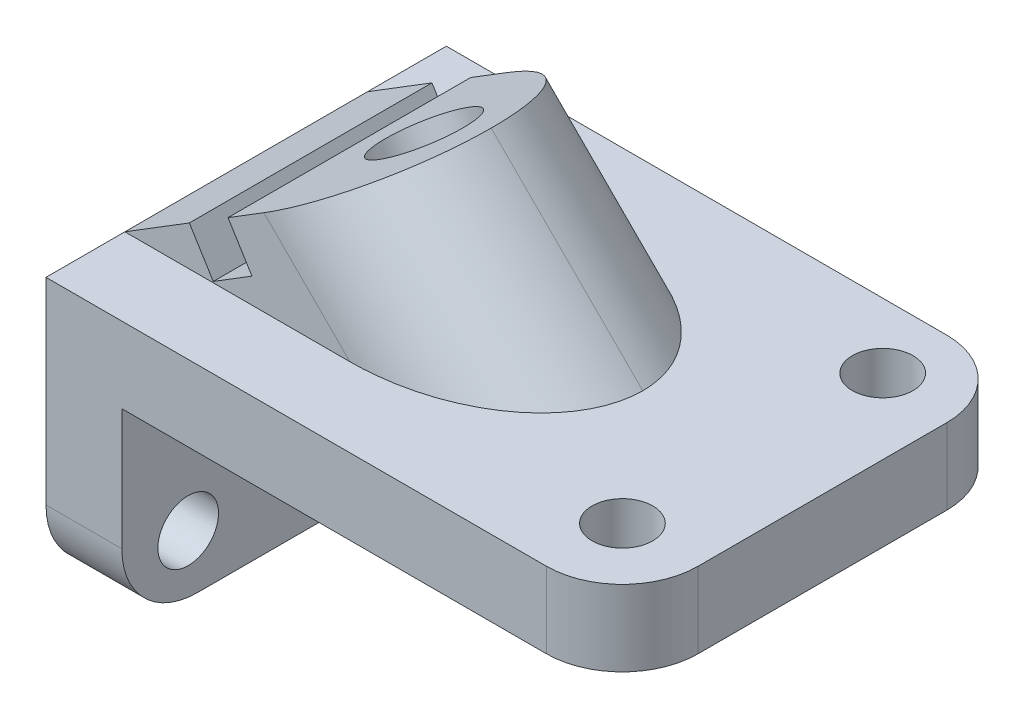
ISO-10303-21;
HEADER;
FILE_DESCRIPTION(('STEP AP214'),'2;1');
FILE_NAME('part.step','',(''),(''),'','','');
FILE_SCHEMA(('AUTOMOTIVE_DESIGN { 1 0 10303 214 1 1 1 1 }'));
ENDSEC;
DATA;
#1=APPLICATION_CONTEXT('core data for automotive mechanical design processes');
#2=APPLICATION_PROTOCOL_DEFINITION('international standard','automotive_design',2000,#1);
#3=PRODUCT_CONTEXT('',#1,'mechanical');
#4=PRODUCT('Part','Part','',(#3));
#5=PRODUCT_RELATED_PRODUCT_CATEGORY('part','',(#4));
#6=PRODUCT_DEFINITION_FORMATION('','',#4);
#7=PRODUCT_DEFINITION_CONTEXT('part definition',#1,'design');
#8=PRODUCT_DEFINITION('design','',#6,#7);
#9=PRODUCT_DEFINITION_SHAPE('','',#8);
#10=(LENGTH_UNIT() NAMED_UNIT(*) SI_UNIT(.MILLI.,.METRE.));
#11=(NAMED_UNIT(*) PLANE_ANGLE_UNIT() SI_UNIT($,.RADIAN.));
#12=(NAMED_UNIT(*) SI_UNIT($,.STERADIAN.) SOLID_ANGLE_UNIT());
#13=UNCERTAINTY_MEASURE_WITH_UNIT(LENGTH_MEASURE(1.E-05),#10,'distance_accuracy_value','');
#14=(GEOMETRIC_REPRESENTATION_CONTEXT(3) GLOBAL_UNCERTAINTY_ASSIGNED_CONTEXT((#13)) GLOBAL_UNIT_ASSIGNED_CONTEXT((#10,
#11,#12)) REPRESENTATION_CONTEXT('',''));
#15=CARTESIAN_POINT('',(0.,0.,0.));
#16=DIRECTION('',(0.,0.,1.));
#17=DIRECTION('',(1.,0.,0.));
#18=AXIS2_PLACEMENT_3D('',#15,#16,#17);
#19=CARTESIAN_POINT('',(-25.,25.,40.));
#20=DIRECTION('',(0.526315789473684,-0.850289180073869,0.));
#21=DIRECTION('',(0.850289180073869,0.526315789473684,0.));
#22=AXIS2_PLACEMENT_3D('',#19,#20,#21);
#23=PLANE('',#22);
#24=CARTESIAN_POINT('',(30.6674510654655,59.457287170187,-2.98131090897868));
#25=DIRECTION('',(-0.526315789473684,0.850289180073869,0.));
#26=DIRECTION('',(-0.850289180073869,-0.526315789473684,0.));
#27=AXIS2_PLACEMENT_3D('',#24,#25,#26);
#28=CIRCLE('',#27,15.);
#29=CARTESIAN_POINT('',(17.9131133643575,51.5625503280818,-2.98131090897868));
#30=VERTEX_POINT('',#29);
#31=EDGE_CURVE('E233',#30,#30,#28,.T.);
#32=ORIENTED_EDGE('',*,*,#31,.F.);
#33=EDGE_LOOP('',(#32));
#34=FACE_BOUND('',#33,.T.);
#35=CARTESIAN_POINT('',(20.8367151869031,53.3722144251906,0.));
#36=DIRECTION('',(0.526315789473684,-0.850289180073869,0.));
#37=DIRECTION('',(0.850289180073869,0.526315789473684,0.));
#38=AXIS2_PLACEMENT_3D('',#35,#36,#37);
#39=ELLIPSE('',#38,41.0927925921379,40.);
#40=CARTESIAN_POINT('',(20.8367151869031,53.3722144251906,40.));
#41=VERTEX_POINT('',#40);
#42=CARTESIAN_POINT('',(55.7774721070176,75.,0.));
#43=VERTEX_POINT('',#42);
#44=EDGE_CURVE('E202',#41,#43,#39,.F.);
#45=ORIENTED_EDGE('',*,*,#44,.T.);
#46=CARTESIAN_POINT('',(20.8367151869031,53.3722144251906,0.));
#47=DIRECTION('',(0.526315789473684,-0.850289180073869,0.));
#48=DIRECTION('',(-0.850289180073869,-0.526315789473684,0.));
#49=AXIS2_PLACEMENT_3D('',#46,#47,#48);
#50=ELLIPSE('',#49,41.0927925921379,40.);
#51=CARTESIAN_POINT('',(20.8367151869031,53.3722144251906,-40.));
#52=VERTEX_POINT('',#51);
#53=EDGE_CURVE('E212',#43,#52,#50,.F.);
#54=ORIENTED_EDGE('',*,*,#53,.T.);
#55=DIRECTION('',(-0.850289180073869,-0.526315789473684,0.));
#56=VECTOR('',#55,1.);
#57=CARTESIAN_POINT('',(-25.,25.,-40.));
#58=LINE('',#57,#56);
#59=CARTESIAN_POINT('',(9.01156720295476,46.0526315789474,-40.));
#60=VERTEX_POINT('',#59);
#61=EDGE_CURVE('E262',#52,#60,#58,.T.);
#62=ORIENTED_EDGE('',*,*,#61,.T.);
#63=DIRECTION('',(0.,0.,-1.));
#64=VECTOR('',#63,1.);
#65=CARTESIAN_POINT('',(9.01156720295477,46.0526315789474,40.));
#66=LINE('',#65,#64);
#67=CARTESIAN_POINT('',(9.01156720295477,46.0526315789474,40.));
#68=VERTEX_POINT('',#67);
#69=EDGE_CURVE('E253',#68,#60,#66,.T.);
#70=ORIENTED_EDGE('',*,*,#69,.F.);
#71=DIRECTION('',(-0.850289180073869,-0.526315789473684,0.));
#72=VECTOR('',#71,1.);
#73=CARTESIAN_POINT('',(-25.,25.,40.));
#74=LINE('',#73,#72);
#75=EDGE_CURVE('E263',#41,#68,#74,.T.);
#76=ORIENTED_EDGE('',*,*,#75,.F.);
#77=EDGE_LOOP('',(#45,#54,#62,#70,#76));
#78=FACE_BOUND('',#77,.T.);
#79=ADVANCED_FACE('F45',(#34,#78),#23,.F.);
#80=DIRECTION('',(0.,0.,1.));
#81=VECTOR('',#80,1.);
#82=CARTESIAN_POINT('',(-3.74277049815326,38.1578947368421,40.));
#83=LINE('',#82,#81);
#84=CARTESIAN_POINT('',(-3.74277049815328,38.1578947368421,-40.));
#85=VERTEX_POINT('',#84);
#86=CARTESIAN_POINT('',(-3.74277049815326,38.1578947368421,40.));
#87=VERTEX_POINT('',#86);
#88=EDGE_CURVE('E250',#85,#87,#83,.T.);
#89=ORIENTED_EDGE('',*,*,#88,.F.);
#90=CARTESIAN_POINT('',(-25.,25.,-40.));
#91=VERTEX_POINT('',#90);
#92=EDGE_CURVE('E195',#85,#91,#58,.T.);
#93=ORIENTED_EDGE('',*,*,#92,.T.);
#94=DIRECTION('',(0.,0.,-1.));
#95=VECTOR('',#94,1.);
#96=CARTESIAN_POINT('',(-25.,25.,40.));
#97=LINE('',#96,#95);
#98=CARTESIAN_POINT('',(-25.,25.,40.));
#99=VERTEX_POINT('',#98);
#100=EDGE_CURVE('E266',#99,#91,#97,.T.);
#101=ORIENTED_EDGE('',*,*,#100,.F.);
#102=EDGE_CURVE('E261',#87,#99,#74,.T.);
#103=ORIENTED_EDGE('',*,*,#102,.F.);
#104=EDGE_LOOP('',(#89,#93,#101,#103));
#105=FACE_BOUND('',#104,.T.);
#106=ADVANCED_FACE('F468',(#105),#23,.F.);
#107=CARTESIAN_POINT('',(0.,0.,40.));
#108=DIRECTION('',(0.,0.,1.));
#109=DIRECTION('',(1.,0.,0.));
#110=AXIS2_PLACEMENT_3D('',#107,#108,#109);
#111=PLANE('',#110);
#112=DIRECTION('',(1.,0.,0.));
#113=VECTOR('',#112,1.);
#114=CARTESIAN_POINT('',(105.777472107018,25.,40.));
#115=LINE('',#114,#113);
#116=CARTESIAN_POINT('',(49.208929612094,25.,40.));
#117=VERTEX_POINT('',#116);
#118=EDGE_CURVE('E258',#99,#117,#115,.T.);
#119=ORIENTED_EDGE('',*,*,#118,.T.);
#120=DIRECTION('',(-0.707106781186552,0.707106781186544,0.));
#121=VECTOR('',#120,1.);
#122=CARTESIAN_POINT('',(27.4932008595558,46.7157287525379,40.));
#123=LINE('',#122,#121);
#124=EDGE_CURVE('E219',#117,#41,#123,.T.);
#125=ORIENTED_EDGE('',*,*,#124,.T.);
#126=ORIENTED_EDGE('',*,*,#75,.T.);
#127=DIRECTION('',(0.526315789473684,-0.850289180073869,0.));
#128=VECTOR('',#127,1.);
#129=CARTESIAN_POINT('',(1.1168303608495,58.8069692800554,40.));
#130=LINE('',#129,#128);
#131=CARTESIAN_POINT('',(16.90630404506,33.2982938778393,40.));
#132=VERTEX_POINT('',#131);
#133=EDGE_CURVE('E244',#68,#132,#130,.T.);
#134=ORIENTED_EDGE('',*,*,#133,.T.);
#135=DIRECTION('',(0.850289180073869,0.526315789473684,0.));
#136=VECTOR('',#135,1.);
#137=CARTESIAN_POINT('',(16.90630404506,33.2982938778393,40.));
#138=LINE('',#137,#136);
#139=CARTESIAN_POINT('',(4.15196634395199,25.4035570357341,40.));
#140=VERTEX_POINT('',#139);
#141=EDGE_CURVE('E180',#140,#132,#138,.T.);
#142=ORIENTED_EDGE('',*,*,#141,.F.);
#143=DIRECTION('',(0.526315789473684,-0.850289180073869,0.));
#144=VECTOR('',#143,1.);
#145=CARTESIAN_POINT('',(-11.6375073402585,50.9122324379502,40.));
#146=LINE('',#145,#144);
#147=EDGE_CURVE('E175',#87,#140,#146,.T.);
#148=ORIENTED_EDGE('',*,*,#147,.F.);
#149=ORIENTED_EDGE('',*,*,#102,.T.);
#150=EDGE_LOOP('',(#119,#125,#126,#134,#142,#148,#149));
#151=FACE_BOUND('',#150,.T.);
#152=ADVANCED_FACE('F495',(#151),#111,.T.);
#153=CARTESIAN_POINT('',(0.,0.,-40.));
#154=DIRECTION('',(0.,0.,1.));
#155=DIRECTION('',(1.,0.,0.));
#156=AXIS2_PLACEMENT_3D('',#153,#154,#155);
#157=PLANE('',#156);
#158=ORIENTED_EDGE('',*,*,#61,.F.);
#159=DIRECTION('',(-0.707106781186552,0.707106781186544,0.));
#160=VECTOR('',#159,1.);
#161=CARTESIAN_POINT('',(37.1044648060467,37.1044648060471,-40.));
#162=LINE('',#161,#160);
#163=CARTESIAN_POINT('',(49.208929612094,25.,-40.));
#164=VERTEX_POINT('',#163);
#165=EDGE_CURVE('E215',#52,#164,#162,.F.);
#166=ORIENTED_EDGE('',*,*,#165,.T.);
#167=DIRECTION('',(1.,0.,0.));
#168=VECTOR('',#167,1.);
#169=CARTESIAN_POINT('',(105.777472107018,25.,-40.));
#170=LINE('',#169,#168);
#171=EDGE_CURVE('E257',#91,#164,#170,.T.);
#172=ORIENTED_EDGE('',*,*,#171,.F.);
#173=ORIENTED_EDGE('',*,*,#92,.F.);
#174=DIRECTION('',(-0.526315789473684,0.850289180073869,0.));
#175=VECTOR('',#174,1.);
#176=CARTESIAN_POINT('',(14.3704527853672,8.89508696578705,-40.));
#177=LINE('',#176,#175);
#178=CARTESIAN_POINT('',(4.15196634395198,25.4035570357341,-40.));
#179=VERTEX_POINT('',#178);
#180=EDGE_CURVE('E172',#179,#85,#177,.T.);
#181=ORIENTED_EDGE('',*,*,#180,.F.);
#182=DIRECTION('',(-0.850289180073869,-0.526315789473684,0.));
#183=VECTOR('',#182,1.);
#184=CARTESIAN_POINT('',(16.90630404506,33.2982938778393,-40.));
#185=LINE('',#184,#183);
#186=CARTESIAN_POINT('',(16.90630404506,33.2982938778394,-40.));
#187=VERTEX_POINT('',#186);
#188=EDGE_CURVE('E181',#187,#179,#185,.T.);
#189=ORIENTED_EDGE('',*,*,#188,.F.);
#190=DIRECTION('',(0.526315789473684,-0.850289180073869,0.));
#191=VECTOR('',#190,1.);
#192=CARTESIAN_POINT('',(27.1247904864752,16.7898238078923,-40.));
#193=LINE('',#192,#191);
#194=EDGE_CURVE('E197',#60,#187,#193,.T.);
#195=ORIENTED_EDGE('',*,*,#194,.F.);
#196=EDGE_LOOP('',(#158,#166,#172,#173,#181,#189,#195));
#197=FACE_BOUND('',#196,.T.);
#198=ADVANCED_FACE('F193',(#197),#157,.F.);
#199=CARTESIAN_POINT('',(0.,0.,66.));
#200=DIRECTION('',(-1.,0.,0.));
#201=DIRECTION('',(0.,-1.,0.));
#202=AXIS2_PLACEMENT_3D('',#199,#200,#201);
#203=PLANE('',#202);
#204=CARTESIAN_POINT('',(0.,-45.768622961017,44.1163839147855));
#205=DIRECTION('',(-1.,0.,0.));
#206=DIRECTION('',(0.,-1.,0.));
#207=AXIS2_PLACEMENT_3D('',#204,#205,#206);
#208=CIRCLE('',#207,10.);
#209=CARTESIAN_POINT('',(0.,-55.768622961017,44.1163839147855));
#210=VERTEX_POINT('',#209);
#211=EDGE_CURVE('E289',#210,#210,#208,.T.);
#212=ORIENTED_EDGE('',*,*,#211,.T.);
#213=EDGE_LOOP('',(#212));
#214=FACE_BOUND('',#213,.T.);
#215=CARTESIAN_POINT('',(0.,-45.768622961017,-42.8836160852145));
#216=DIRECTION('',(-1.,0.,0.));
#217=DIRECTION('',(0.,-1.,0.));
#218=AXIS2_PLACEMENT_3D('',#215,#216,#217);
#219=CIRCLE('',#218,10.);
#220=CARTESIAN_POINT('',(0.,-55.768622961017,-42.8836160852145));
#221=VERTEX_POINT('',#220);
#222=EDGE_CURVE('E284',#221,#221,#219,.T.);
#223=ORIENTED_EDGE('',*,*,#222,.T.);
#224=EDGE_LOOP('',(#223));
#225=FACE_BOUND('',#224,.T.);
#226=DIRECTION('',(0.,1.,0.));
#227=VECTOR('',#226,1.);
#228=CARTESIAN_POINT('',(0.,0.,66.));
#229=LINE('',#228,#227);
#230=CARTESIAN_POINT('',(0.,-40.,66.));
#231=VERTEX_POINT('',#230);
#232=CARTESIAN_POINT('',(0.,0.,66.));
#233=VERTEX_POINT('',#232);
#234=EDGE_CURVE('E294',#231,#233,#229,.T.);
#235=ORIENTED_EDGE('',*,*,#234,.F.);
#236=CARTESIAN_POINT('',(0.,-40.,41.));
#237=DIRECTION('',(-1.,0.,0.));
#238=DIRECTION('',(0.,-1.,0.));
#239=AXIS2_PLACEMENT_3D('',#236,#237,#238);
#240=CIRCLE('',#239,25.);
#241=CARTESIAN_POINT('',(0.,-65.,41.));
#242=VERTEX_POINT('',#241);
#243=EDGE_CURVE('E358',#231,#242,#240,.F.);
#244=ORIENTED_EDGE('',*,*,#243,.T.);
#245=DIRECTION('',(0.,0.,-1.));
#246=VECTOR('',#245,1.);
#247=CARTESIAN_POINT('',(0.,-65.,66.));
#248=LINE('',#247,#246);
#249=CARTESIAN_POINT('',(0.,-65.,-41.));
#250=VERTEX_POINT('',#249);
#251=EDGE_CURVE('E309',#242,#250,#248,.T.);
#252=ORIENTED_EDGE('',*,*,#251,.T.);
#253=CARTESIAN_POINT('',(0.,-40.,-41.));
#254=DIRECTION('',(-1.,0.,0.));
#255=DIRECTION('',(0.,-1.,0.));
#256=AXIS2_PLACEMENT_3D('',#253,#254,#255);
#257=CIRCLE('',#256,25.);
#258=CARTESIAN_POINT('',(0.,-40.,-66.));
#259=VERTEX_POINT('',#258);
#260=EDGE_CURVE('E355',#250,#259,#257,.F.);
#261=ORIENTED_EDGE('',*,*,#260,.T.);
#262=DIRECTION('',(0.,1.,0.));
#263=VECTOR('',#262,1.);
#264=CARTESIAN_POINT('',(0.,0.,-66.));
#265=LINE('',#264,#263);
#266=CARTESIAN_POINT('',(0.,0.,-66.));
#267=VERTEX_POINT('',#266);
#268=EDGE_CURVE('E293',#259,#267,#265,.T.);
#269=ORIENTED_EDGE('',*,*,#268,.T.);
#270=DIRECTION('',(0.,0.,-1.));
#271=VECTOR('',#270,1.);
#272=CARTESIAN_POINT('',(0.,0.,66.));
#273=LINE('',#272,#271);
#274=EDGE_CURVE('E343',#233,#267,#273,.T.);
#275=ORIENTED_EDGE('',*,*,#274,.F.);
#276=EDGE_LOOP('',(#235,#244,#252,#261,#269,#275));
#277=FACE_BOUND('',#276,.T.);
#278=ADVANCED_FACE('F418',(#214,#225,#277),#203,.F.);
#279=CARTESIAN_POINT('',(0.,0.,66.));
#280=DIRECTION('',(0.,1.,0.));
#281=DIRECTION('',(0.,0.,1.));
#282=AXIS2_PLACEMENT_3D('',#279,#280,#281);
#283=PLANE('',#282);
#284=CARTESIAN_POINT('',(67.4705878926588,0.,-2.98131090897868));
#285=DIRECTION('',(0.,1.,0.));
#286=DIRECTION('',(-1.,0.,0.));
#287=AXIS2_PLACEMENT_3D('',#284,#285,#286);
#288=ELLIPSE('',#287,17.6410571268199,15.);
#289=CARTESIAN_POINT('',(49.8295307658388,0.,-2.98131090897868));
#290=VERTEX_POINT('',#289);
#291=EDGE_CURVE('E49',#290,#290,#288,.T.);
#292=ORIENTED_EDGE('',*,*,#291,.T.);
#293=EDGE_LOOP('',(#292));
#294=FACE_BOUND('',#293,.T.);
#295=CARTESIAN_POINT('',(140.285841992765,0.,-44.5766194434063));
#296=DIRECTION('',(0.,1.,0.));
#297=DIRECTION('',(0.,0.,1.));
#298=AXIS2_PLACEMENT_3D('',#295,#296,#297);
#299=CIRCLE('',#298,10.);
#300=CARTESIAN_POINT('',(140.285841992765,0.,-34.5766194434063));
#301=VERTEX_POINT('',#300);
#302=EDGE_CURVE('E279',#301,#301,#299,.T.);
#303=ORIENTED_EDGE('',*,*,#302,.T.);
#304=EDGE_LOOP('',(#303));
#305=FACE_BOUND('',#304,.T.);
#306=CARTESIAN_POINT('',(140.285841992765,0.,41.2331639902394));
#307=DIRECTION('',(0.,1.,0.));
#308=DIRECTION('',(0.,0.,1.));
#309=AXIS2_PLACEMENT_3D('',#306,#307,#308);
#310=CIRCLE('',#309,10.);
#311=CARTESIAN_POINT('',(140.285841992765,0.,51.2331639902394));
#312=VERTEX_POINT('',#311);
#313=EDGE_CURVE('E275',#312,#312,#310,.T.);
#314=ORIENTED_EDGE('',*,*,#313,.T.);
#315=EDGE_LOOP('',(#314));
#316=FACE_BOUND('',#315,.T.);
#317=DIRECTION('',(1.,0.,0.));
#318=VECTOR('',#317,1.);
#319=CARTESIAN_POINT('',(0.,0.,-66.));
#320=LINE('',#319,#318);
#321=CARTESIAN_POINT('',(140.,0.,-66.));
#322=VERTEX_POINT('',#321);
#323=EDGE_CURVE('E312',#267,#322,#320,.T.);
#324=ORIENTED_EDGE('',*,*,#323,.T.);
#325=CARTESIAN_POINT('',(140.,0.,-41.));
#326=DIRECTION('',(0.,1.,0.));
#327=DIRECTION('',(0.,0.,1.));
#328=AXIS2_PLACEMENT_3D('',#325,#326,#327);
#329=CIRCLE('',#328,25.);
#330=CARTESIAN_POINT('',(165.,0.,-41.));
#331=VERTEX_POINT('',#330);
#332=EDGE_CURVE('E198',#322,#331,#329,.F.);
#333=ORIENTED_EDGE('',*,*,#332,.T.);
#334=DIRECTION('',(0.,0.,-1.));
#335=VECTOR('',#334,1.);
#336=CARTESIAN_POINT('',(165.,0.,66.));
#337=LINE('',#336,#335);
#338=CARTESIAN_POINT('',(165.,0.,41.));
#339=VERTEX_POINT('',#338);
#340=EDGE_CURVE('E339',#339,#331,#337,.T.);
#341=ORIENTED_EDGE('',*,*,#340,.F.);
#342=CARTESIAN_POINT('',(140.,0.,41.));
#343=DIRECTION('',(0.,1.,0.));
#344=DIRECTION('',(0.,0.,1.));
#345=AXIS2_PLACEMENT_3D('',#342,#343,#344);
#346=CIRCLE('',#345,25.);
#347=CARTESIAN_POINT('',(140.,0.,66.));
#348=VERTEX_POINT('',#347);
#349=EDGE_CURVE('E204',#339,#348,#346,.F.);
#350=ORIENTED_EDGE('',*,*,#349,.T.);
#351=DIRECTION('',(1.,0.,0.));
#352=VECTOR('',#351,1.);
#353=CARTESIAN_POINT('',(0.,0.,66.));
#354=LINE('',#353,#352);
#355=EDGE_CURVE('E297',#233,#348,#354,.T.);
#356=ORIENTED_EDGE('',*,*,#355,.F.);
#357=ORIENTED_EDGE('',*,*,#274,.T.);
#358=EDGE_LOOP('',(#324,#333,#341,#350,#356,#357));
#359=FACE_BOUND('',#358,.T.);
#360=ADVANCED_FACE('F414',(#294,#305,#316,#359),#283,.F.);
#361=CARTESIAN_POINT('',(165.,25.,66.));
#362=DIRECTION('',(-1.,0.,0.));
#363=DIRECTION('',(0.,-1.,0.));
#364=AXIS2_PLACEMENT_3D('',#361,#362,#363);
#365=PLANE('',#364);
#366=ORIENTED_EDGE('',*,*,#340,.T.);
#367=DIRECTION('',(0.,1.,0.));
#368=VECTOR('',#367,1.);
#369=CARTESIAN_POINT('',(165.,25.,-41.));
#370=LINE('',#369,#368);
#371=CARTESIAN_POINT('',(165.,25.,-41.));
#372=VERTEX_POINT('',#371);
#373=EDGE_CURVE('E383',#331,#372,#370,.T.);
#374=ORIENTED_EDGE('',*,*,#373,.T.);
#375=DIRECTION('',(0.,0.,-1.));
#376=VECTOR('',#375,1.);
#377=CARTESIAN_POINT('',(165.,25.,66.));
#378=LINE('',#377,#376);
#379=CARTESIAN_POINT('',(165.,25.,41.));
#380=VERTEX_POINT('',#379);
#381=EDGE_CURVE('E335',#380,#372,#378,.T.);
#382=ORIENTED_EDGE('',*,*,#381,.F.);
#383=DIRECTION('',(0.,1.,0.));
#384=VECTOR('',#383,1.);
#385=CARTESIAN_POINT('',(165.,25.,41.));
#386=LINE('',#385,#384);
#387=EDGE_CURVE('E380',#380,#339,#386,.F.);
#388=ORIENTED_EDGE('',*,*,#387,.T.);
#389=EDGE_LOOP('',(#366,#374,#382,#388));
#390=FACE_BOUND('',#389,.T.);
#391=ADVANCED_FACE('F417',(#390),#365,.F.);
#392=CARTESIAN_POINT('',(-25.,25.,66.));
#393=DIRECTION('',(0.,-1.,0.));
#394=DIRECTION('',(0.,0.,-1.));
#395=AXIS2_PLACEMENT_3D('',#392,#393,#394);
#396=PLANE('',#395);
#397=CARTESIAN_POINT('',(140.285841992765,25.,-44.5766194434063));
#398=DIRECTION('',(0.,-1.,0.));
#399=DIRECTION('',(0.,0.,-1.));
#400=AXIS2_PLACEMENT_3D('',#397,#398,#399);
#401=CIRCLE('',#400,10.);
#402=CARTESIAN_POINT('',(140.285841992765,25.,-34.5766194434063));
#403=VERTEX_POINT('',#402);
#404=EDGE_CURVE('E207',#403,#403,#401,.T.);
#405=ORIENTED_EDGE('',*,*,#404,.T.);
#406=EDGE_LOOP('',(#405));
#407=FACE_BOUND('',#406,.T.);
#408=CARTESIAN_POINT('',(140.285841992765,25.,41.2331639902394));
#409=DIRECTION('',(0.,-1.,0.));
#410=DIRECTION('',(0.,0.,-1.));
#411=AXIS2_PLACEMENT_3D('',#408,#409,#410);
#412=CIRCLE('',#411,10.);
#413=CARTESIAN_POINT('',(140.285841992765,25.,51.2331639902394));
#414=VERTEX_POINT('',#413);
#415=EDGE_CURVE('E274',#414,#414,#412,.T.);
#416=ORIENTED_EDGE('',*,*,#415,.T.);
#417=EDGE_LOOP('',(#416));
#418=FACE_BOUND('',#417,.T.);
#419=DIRECTION('',(0.,0.,-1.));
#420=VECTOR('',#419,1.);
#421=CARTESIAN_POINT('',(-25.,25.,66.));
#422=LINE('',#421,#420);
#423=CARTESIAN_POINT('',(-25.,25.,-66.));
#424=VERTEX_POINT('',#423);
#425=EDGE_CURVE('E330',#91,#424,#422,.T.);
#426=ORIENTED_EDGE('',*,*,#425,.F.);
#427=ORIENTED_EDGE('',*,*,#171,.T.);
#428=CARTESIAN_POINT('',(49.208929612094,25.,0.));
#429=DIRECTION('',(0.,-1.,0.));
#430=DIRECTION('',(-1.,0.,0.));
#431=AXIS2_PLACEMENT_3D('',#428,#429,#430);
#432=ELLIPSE('',#431,56.5685424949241,40.);
#433=CARTESIAN_POINT('',(105.777472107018,25.,0.));
#434=VERTEX_POINT('',#433);
#435=EDGE_CURVE('E55',#164,#434,#432,.T.);
#436=ORIENTED_EDGE('',*,*,#435,.T.);
#437=CARTESIAN_POINT('',(49.208929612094,25.,0.));
#438=DIRECTION('',(0.,-1.,0.));
#439=DIRECTION('',(1.,0.,0.));
#440=AXIS2_PLACEMENT_3D('',#437,#438,#439);
#441=ELLIPSE('',#440,56.5685424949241,40.);
#442=EDGE_CURVE('E11',#434,#117,#441,.T.);
#443=ORIENTED_EDGE('',*,*,#442,.T.);
#444=ORIENTED_EDGE('',*,*,#118,.F.);
#445=CARTESIAN_POINT('',(-25.,25.,66.));
#446=VERTEX_POINT('',#445);
#447=EDGE_CURVE('E331',#446,#99,#422,.T.);
#448=ORIENTED_EDGE('',*,*,#447,.F.);
#449=DIRECTION('',(-1.,0.,0.));
#450=VECTOR('',#449,1.);
#451=CARTESIAN_POINT('',(-25.,25.,66.));
#452=LINE('',#451,#450);
#453=CARTESIAN_POINT('',(140.,25.,66.));
#454=VERTEX_POINT('',#453);
#455=EDGE_CURVE('E302',#454,#446,#452,.T.);
#456=ORIENTED_EDGE('',*,*,#455,.F.);
#457=CARTESIAN_POINT('',(140.,25.,41.));
#458=DIRECTION('',(0.,-1.,0.));
#459=DIRECTION('',(0.,0.,-1.));
#460=AXIS2_PLACEMENT_3D('',#457,#458,#459);
#461=CIRCLE('',#460,25.);
#462=EDGE_CURVE('E387',#454,#380,#461,.F.);
#463=ORIENTED_EDGE('',*,*,#462,.T.);
#464=ORIENTED_EDGE('',*,*,#381,.T.);
#465=CARTESIAN_POINT('',(140.,25.,-41.));
#466=DIRECTION('',(0.,-1.,0.));
#467=DIRECTION('',(0.,0.,-1.));
#468=AXIS2_PLACEMENT_3D('',#465,#466,#467);
#469=CIRCLE('',#468,25.);
#470=CARTESIAN_POINT('',(140.,25.,-66.));
#471=VERTEX_POINT('',#470);
#472=EDGE_CURVE('E390',#372,#471,#469,.F.);
#473=ORIENTED_EDGE('',*,*,#472,.T.);
#474=DIRECTION('',(-1.,0.,0.));
#475=VECTOR('',#474,1.);
#476=CARTESIAN_POINT('',(-25.,25.,-66.));
#477=LINE('',#476,#475);
#478=EDGE_CURVE('E316',#471,#424,#477,.T.);
#479=ORIENTED_EDGE('',*,*,#478,.T.);
#480=EDGE_LOOP('',(#426,#427,#436,#443,#444,#448,#456,#463,#464,#473,#479));
#481=FACE_BOUND('',#480,.T.);
#482=ADVANCED_FACE('F404',(#407,#418,#481),#396,.F.);
#483=CARTESIAN_POINT('',(-25.,-65.,66.));
#484=DIRECTION('',(1.,0.,0.));
#485=DIRECTION('',(0.,1.,0.));
#486=AXIS2_PLACEMENT_3D('',#483,#484,#485);
#487=PLANE('',#486);
#488=CARTESIAN_POINT('',(-25.,-45.768622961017,44.1163839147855));
#489=DIRECTION('',(1.,0.,0.));
#490=DIRECTION('',(0.,1.,0.));
#491=AXIS2_PLACEMENT_3D('',#488,#489,#490);
#492=CIRCLE('',#491,10.);
#493=CARTESIAN_POINT('',(-25.,-35.768622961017,44.1163839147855));
#494=VERTEX_POINT('',#493);
#495=EDGE_CURVE('E288',#494,#494,#492,.T.);
#496=ORIENTED_EDGE('',*,*,#495,.T.);
#497=EDGE_LOOP('',(#496));
#498=FACE_BOUND('',#497,.T.);
#499=CARTESIAN_POINT('',(-25.,-45.768622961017,-42.8836160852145));
#500=DIRECTION('',(1.,0.,0.));
#501=DIRECTION('',(0.,1.,0.));
#502=AXIS2_PLACEMENT_3D('',#499,#500,#501);
#503=CIRCLE('',#502,10.);
#504=CARTESIAN_POINT('',(-25.,-35.768622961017,-42.8836160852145));
#505=VERTEX_POINT('',#504);
#506=EDGE_CURVE('E283',#505,#505,#503,.T.);
#507=ORIENTED_EDGE('',*,*,#506,.T.);
#508=EDGE_LOOP('',(#507));
#509=FACE_BOUND('',#508,.T.);
#510=DIRECTION('',(0.,0.,-1.));
#511=VECTOR('',#510,1.);
#512=CARTESIAN_POINT('',(-25.,-65.,66.));
#513=LINE('',#512,#511);
#514=CARTESIAN_POINT('',(-25.,-65.,41.));
#515=VERTEX_POINT('',#514);
#516=CARTESIAN_POINT('',(-25.,-65.,-41.));
#517=VERTEX_POINT('',#516);
#518=EDGE_CURVE('E326',#515,#517,#513,.T.);
#519=ORIENTED_EDGE('',*,*,#518,.F.);
#520=CARTESIAN_POINT('',(-25.,-40.,41.));
#521=DIRECTION('',(1.,0.,0.));
#522=DIRECTION('',(0.,1.,0.));
#523=AXIS2_PLACEMENT_3D('',#520,#521,#522);
#524=CIRCLE('',#523,25.);
#525=CARTESIAN_POINT('',(-25.,-40.,66.));
#526=VERTEX_POINT('',#525);
#527=EDGE_CURVE('E371',#515,#526,#524,.F.);
#528=ORIENTED_EDGE('',*,*,#527,.T.);
#529=DIRECTION('',(0.,-1.,0.));
#530=VECTOR('',#529,1.);
#531=CARTESIAN_POINT('',(-25.,-65.,66.));
#532=LINE('',#531,#530);
#533=EDGE_CURVE('E305',#446,#526,#532,.T.);
#534=ORIENTED_EDGE('',*,*,#533,.F.);
#535=ORIENTED_EDGE('',*,*,#447,.T.);
#536=ORIENTED_EDGE('',*,*,#100,.T.);
#537=ORIENTED_EDGE('',*,*,#425,.T.);
#538=DIRECTION('',(0.,-1.,0.));
#539=VECTOR('',#538,1.);
#540=CARTESIAN_POINT('',(-25.,-65.,-66.));
#541=LINE('',#540,#539);
#542=CARTESIAN_POINT('',(-25.,-40.,-66.));
#543=VERTEX_POINT('',#542);
#544=EDGE_CURVE('E298',#424,#543,#541,.T.);
#545=ORIENTED_EDGE('',*,*,#544,.T.);
#546=CARTESIAN_POINT('',(-25.,-40.,-41.));
#547=DIRECTION('',(1.,0.,0.));
#548=DIRECTION('',(0.,1.,0.));
#549=AXIS2_PLACEMENT_3D('',#546,#547,#548);
#550=CIRCLE('',#549,25.);
#551=EDGE_CURVE('E368',#543,#517,#550,.F.);
#552=ORIENTED_EDGE('',*,*,#551,.T.);
#553=EDGE_LOOP('',(#519,#528,#534,#535,#536,#537,#545,#552));
#554=FACE_BOUND('',#553,.T.);
#555=ADVANCED_FACE('F455',(#498,#509,#554),#487,.F.);
#556=CARTESIAN_POINT('',(0.,-65.,66.));
#557=DIRECTION('',(0.,1.,0.));
#558=DIRECTION('',(0.,0.,1.));
#559=AXIS2_PLACEMENT_3D('',#556,#557,#558);
#560=PLANE('',#559);
#561=ORIENTED_EDGE('',*,*,#251,.F.);
#562=DIRECTION('',(1.,0.,0.));
#563=VECTOR('',#562,1.);
#564=CARTESIAN_POINT('',(0.,-65.,41.));
#565=LINE('',#564,#563);
#566=EDGE_CURVE('E365',#242,#515,#565,.F.);
#567=ORIENTED_EDGE('',*,*,#566,.T.);
#568=ORIENTED_EDGE('',*,*,#518,.T.);
#569=DIRECTION('',(1.,0.,0.));
#570=VECTOR('',#569,1.);
#571=CARTESIAN_POINT('',(0.,-65.,-41.));
#572=LINE('',#571,#570);
#573=EDGE_CURVE('E361',#517,#250,#572,.T.);
#574=ORIENTED_EDGE('',*,*,#573,.T.);
#575=EDGE_LOOP('',(#561,#567,#568,#574));
#576=FACE_BOUND('',#575,.T.);
#577=ADVANCED_FACE('F459',(#576),#560,.F.);
#578=CARTESIAN_POINT('',(0.,0.,66.));
#579=DIRECTION('',(0.,0.,-1.));
#580=DIRECTION('',(-1.,0.,0.));
#581=AXIS2_PLACEMENT_3D('',#578,#579,#580);
#582=PLANE('',#581);
#583=ORIENTED_EDGE('',*,*,#533,.T.);
#584=DIRECTION('',(1.,0.,0.));
#585=VECTOR('',#584,1.);
#586=CARTESIAN_POINT('',(0.,-40.,66.));
#587=LINE('',#586,#585);
#588=EDGE_CURVE('E351',#526,#231,#587,.T.);
#589=ORIENTED_EDGE('',*,*,#588,.T.);
#590=ORIENTED_EDGE('',*,*,#234,.T.);
#591=ORIENTED_EDGE('',*,*,#355,.T.);
#592=DIRECTION('',(0.,1.,0.));
#593=VECTOR('',#592,1.);
#594=CARTESIAN_POINT('',(140.,1.55431223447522E-13,66.));
#595=LINE('',#594,#593);
#596=EDGE_CURVE('E347',#348,#454,#595,.T.);
#597=ORIENTED_EDGE('',*,*,#596,.T.);
#598=ORIENTED_EDGE('',*,*,#455,.T.);
#599=EDGE_LOOP('',(#583,#589,#590,#591,#597,#598));
#600=FACE_BOUND('',#599,.T.);
#601=ADVANCED_FACE('F443',(#600),#582,.F.);
#602=CARTESIAN_POINT('',(0.,0.,-66.));
#603=DIRECTION('',(0.,0.,-1.));
#604=DIRECTION('',(-1.,0.,0.));
#605=AXIS2_PLACEMENT_3D('',#602,#603,#604);
#606=PLANE('',#605);
#607=ORIENTED_EDGE('',*,*,#268,.F.);
#608=DIRECTION('',(1.,0.,0.));
#609=VECTOR('',#608,1.);
#610=CARTESIAN_POINT('',(-25.,-40.,-66.));
#611=LINE('',#610,#609);
#612=EDGE_CURVE('E377',#259,#543,#611,.F.);
#613=ORIENTED_EDGE('',*,*,#612,.T.);
#614=ORIENTED_EDGE('',*,*,#544,.F.);
#615=ORIENTED_EDGE('',*,*,#478,.F.);
#616=DIRECTION('',(0.,1.,0.));
#617=VECTOR('',#616,1.);
#618=CARTESIAN_POINT('',(140.,0.,-66.));
#619=LINE('',#618,#617);
#620=EDGE_CURVE('E374',#471,#322,#619,.F.);
#621=ORIENTED_EDGE('',*,*,#620,.T.);
#622=ORIENTED_EDGE('',*,*,#323,.F.);
#623=EDGE_LOOP('',(#607,#613,#614,#615,#621,#622));
#624=FACE_BOUND('',#623,.T.);
#625=ADVANCED_FACE('F447',(#624),#606,.T.);
#626=CARTESIAN_POINT('',(0.,-40.,41.));
#627=DIRECTION('',(1.,0.,0.));
#628=DIRECTION('',(0.,0.,-1.));
#629=AXIS2_PLACEMENT_3D('',#626,#627,#628);
#630=CYLINDRICAL_SURFACE('',#629,25.);
#631=ORIENTED_EDGE('',*,*,#527,.F.);
#632=ORIENTED_EDGE('',*,*,#566,.F.);
#633=ORIENTED_EDGE('',*,*,#243,.F.);
#634=ORIENTED_EDGE('',*,*,#588,.F.);
#635=EDGE_LOOP('',(#631,#632,#633,#634));
#636=FACE_BOUND('',#635,.T.);
#637=ADVANCED_FACE('F462',(#636),#630,.T.);
#638=CARTESIAN_POINT('',(0.,-40.,-41.));
#639=DIRECTION('',(-1.,0.,0.));
#640=DIRECTION('',(0.,0.,1.));
#641=AXIS2_PLACEMENT_3D('',#638,#639,#640);
#642=CYLINDRICAL_SURFACE('',#641,25.);
#643=ORIENTED_EDGE('',*,*,#551,.F.);
#644=ORIENTED_EDGE('',*,*,#612,.F.);
#645=ORIENTED_EDGE('',*,*,#260,.F.);
#646=ORIENTED_EDGE('',*,*,#573,.F.);
#647=EDGE_LOOP('',(#643,#644,#645,#646));
#648=FACE_BOUND('',#647,.T.);
#649=ADVANCED_FACE('F451',(#648),#642,.T.);
#650=CARTESIAN_POINT('',(140.,25.,-41.));
#651=DIRECTION('',(0.,-1.,0.));
#652=DIRECTION('',(1.,0.,0.));
#653=AXIS2_PLACEMENT_3D('',#650,#651,#652);
#654=CYLINDRICAL_SURFACE('',#653,25.);
#655=ORIENTED_EDGE('',*,*,#332,.F.);
#656=ORIENTED_EDGE('',*,*,#620,.F.);
#657=ORIENTED_EDGE('',*,*,#472,.F.);
#658=ORIENTED_EDGE('',*,*,#373,.F.);
#659=EDGE_LOOP('',(#655,#656,#657,#658));
#660=FACE_BOUND('',#659,.T.);
#661=ADVANCED_FACE('F430',(#660),#654,.T.);
#662=CARTESIAN_POINT('',(140.,1.55431223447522E-13,41.));
#663=DIRECTION('',(0.,1.,0.));
#664=DIRECTION('',(-1.,0.,0.));
#665=AXIS2_PLACEMENT_3D('',#662,#663,#664);
#666=CYLINDRICAL_SURFACE('',#665,25.);
#667=ORIENTED_EDGE('',*,*,#349,.F.);
#668=ORIENTED_EDGE('',*,*,#387,.F.);
#669=ORIENTED_EDGE('',*,*,#462,.F.);
#670=ORIENTED_EDGE('',*,*,#596,.F.);
#671=EDGE_LOOP('',(#667,#668,#669,#670));
#672=FACE_BOUND('',#671,.T.);
#673=ADVANCED_FACE('F441',(#672),#666,.T.);
#674=CARTESIAN_POINT('',(165.,-45.768622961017,-42.8836160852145));
#675=DIRECTION('',(-1.,0.,0.));
#676=DIRECTION('',(0.,-1.,0.));
#677=AXIS2_PLACEMENT_3D('',#674,#675,#676);
#678=CYLINDRICAL_SURFACE('',#677,10.);
#679=ORIENTED_EDGE('',*,*,#506,.F.);
#680=EDGE_LOOP('',(#679));
#681=FACE_BOUND('',#680,.T.);
#682=ORIENTED_EDGE('',*,*,#222,.F.);
#683=EDGE_LOOP('',(#682));
#684=FACE_BOUND('',#683,.T.);
#685=ADVANCED_FACE('F520',(#681,#684),#678,.F.);
#686=CARTESIAN_POINT('',(165.,-45.768622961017,44.1163839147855));
#687=DIRECTION('',(-1.,0.,0.));
#688=DIRECTION('',(0.,-1.,0.));
#689=AXIS2_PLACEMENT_3D('',#686,#687,#688);
#690=CYLINDRICAL_SURFACE('',#689,10.);
#691=ORIENTED_EDGE('',*,*,#495,.F.);
#692=EDGE_LOOP('',(#691));
#693=FACE_BOUND('',#692,.T.);
#694=ORIENTED_EDGE('',*,*,#211,.F.);
#695=EDGE_LOOP('',(#694));
#696=FACE_BOUND('',#695,.T.);
#697=ADVANCED_FACE('F410',(#693,#696),#690,.F.);
#698=CARTESIAN_POINT('',(140.285841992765,-65.,41.2331639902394));
#699=DIRECTION('',(0.,1.,0.));
#700=DIRECTION('',(0.,0.,1.));
#701=AXIS2_PLACEMENT_3D('',#698,#699,#700);
#702=CYLINDRICAL_SURFACE('',#701,10.);
#703=CARTESIAN_POINT('',(140.285841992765,25.,51.2331639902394));
#704=CARTESIAN_POINT('',(140.285841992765,24.7395833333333,51.2331639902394));
#705=CARTESIAN_POINT('',(140.285841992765,24.4791666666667,51.2331639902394));
#706=CARTESIAN_POINT('',(140.285841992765,23.9583333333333,51.2331639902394));
#707=CARTESIAN_POINT('',(140.285841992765,23.6979166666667,51.2331639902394));
#708=CARTESIAN_POINT('',(140.285841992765,23.1770833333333,51.2331639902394));
#709=CARTESIAN_POINT('',(140.285841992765,22.9166666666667,51.2331639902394));
#710=CARTESIAN_POINT('',(140.285841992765,22.3958333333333,51.2331639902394));
#711=CARTESIAN_POINT('',(140.285841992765,22.1354166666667,51.2331639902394));
#712=CARTESIAN_POINT('',(140.285841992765,21.6145833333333,51.2331639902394));
#713=CARTESIAN_POINT('',(140.285841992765,21.3541666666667,51.2331639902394));
#714=CARTESIAN_POINT('',(140.285841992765,20.8333333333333,51.2331639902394));
#715=CARTESIAN_POINT('',(140.285841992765,20.5729166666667,51.2331639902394));
#716=CARTESIAN_POINT('',(140.285841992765,20.0520833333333,51.2331639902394));
#717=CARTESIAN_POINT('',(140.285841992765,19.7916666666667,51.2331639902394));
#718=CARTESIAN_POINT('',(140.285841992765,19.2708333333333,51.2331639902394));
#719=CARTESIAN_POINT('',(140.285841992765,19.0104166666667,51.2331639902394));
#720=CARTESIAN_POINT('',(140.285841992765,18.4895833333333,51.2331639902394));
#721=CARTESIAN_POINT('',(140.285841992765,18.2291666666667,51.2331639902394));
#722=CARTESIAN_POINT('',(140.285841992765,17.7083333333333,51.2331639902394));
#723=CARTESIAN_POINT('',(140.285841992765,17.4479166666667,51.2331639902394));
#724=CARTESIAN_POINT('',(140.285841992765,16.9270833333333,51.2331639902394));
#725=CARTESIAN_POINT('',(140.285841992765,16.6666666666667,51.2331639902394));
#726=CARTESIAN_POINT('',(140.285841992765,16.1458333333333,51.2331639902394));
#727=CARTESIAN_POINT('',(140.285841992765,15.8854166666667,51.2331639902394));
#728=CARTESIAN_POINT('',(140.285841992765,15.3645833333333,51.2331639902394));
#729=CARTESIAN_POINT('',(140.285841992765,15.1041666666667,51.2331639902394));
#730=CARTESIAN_POINT('',(140.285841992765,14.5833333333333,51.2331639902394));
#731=CARTESIAN_POINT('',(140.285841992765,14.3229166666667,51.2331639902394));
#732=CARTESIAN_POINT('',(140.285841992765,13.8020833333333,51.2331639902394));
#733=CARTESIAN_POINT('',(140.285841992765,13.5416666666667,51.2331639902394));
#734=CARTESIAN_POINT('',(140.285841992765,13.0208333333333,51.2331639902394));
#735=CARTESIAN_POINT('',(140.285841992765,12.7604166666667,51.2331639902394));
#736=CARTESIAN_POINT('',(140.285841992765,12.2395833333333,51.2331639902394));
#737=CARTESIAN_POINT('',(140.285841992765,11.9791666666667,51.2331639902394));
#738=CARTESIAN_POINT('',(140.285841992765,11.4583333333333,51.2331639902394));
#739=CARTESIAN_POINT('',(140.285841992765,11.1979166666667,51.2331639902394));
#740=CARTESIAN_POINT('',(140.285841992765,10.6770833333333,51.2331639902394));
#741=CARTESIAN_POINT('',(140.285841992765,10.4166666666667,51.2331639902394));
#742=CARTESIAN_POINT('',(140.285841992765,9.89583333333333,51.2331639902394));
#743=CARTESIAN_POINT('',(140.285841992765,9.63541666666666,51.2331639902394));
#744=CARTESIAN_POINT('',(140.285841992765,9.11458333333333,51.2331639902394));
#745=CARTESIAN_POINT('',(140.285841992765,8.85416666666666,51.2331639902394));
#746=CARTESIAN_POINT('',(140.285841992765,8.33333333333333,51.2331639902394));
#747=CARTESIAN_POINT('',(140.285841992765,8.07291666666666,51.2331639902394));
#748=CARTESIAN_POINT('',(140.285841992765,7.55208333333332,51.2331639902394));
#749=CARTESIAN_POINT('',(140.285841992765,7.29166666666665,51.2331639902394));
#750=CARTESIAN_POINT('',(140.285841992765,6.77083333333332,51.2331639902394));
#751=CARTESIAN_POINT('',(140.285841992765,6.51041666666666,51.2331639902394));
#752=CARTESIAN_POINT('',(140.285841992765,5.98958333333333,51.2331639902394));
#753=CARTESIAN_POINT('',(140.285841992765,5.72916666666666,51.2331639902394));
#754=CARTESIAN_POINT('',(140.285841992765,5.20833333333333,51.2331639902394));
#755=CARTESIAN_POINT('',(140.285841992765,4.94791666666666,51.2331639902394));
#756=CARTESIAN_POINT('',(140.285841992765,4.42708333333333,51.2331639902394));
#757=CARTESIAN_POINT('',(140.285841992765,4.16666666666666,51.2331639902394));
#758=CARTESIAN_POINT('',(140.285841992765,3.64583333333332,51.2331639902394));
#759=CARTESIAN_POINT('',(140.285841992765,3.38541666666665,51.2331639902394));
#760=CARTESIAN_POINT('',(140.285841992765,2.86458333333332,51.2331639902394));
#761=CARTESIAN_POINT('',(140.285841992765,2.60416666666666,51.2331639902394));
#762=CARTESIAN_POINT('',(140.285841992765,2.08333333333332,51.2331639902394));
#763=CARTESIAN_POINT('',(140.285841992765,1.82291666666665,51.2331639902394));
#764=CARTESIAN_POINT('',(140.285841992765,1.30208333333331,51.2331639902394));
#765=CARTESIAN_POINT('',(140.285841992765,1.04166666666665,51.2331639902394));
#766=CARTESIAN_POINT('',(140.285841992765,0.520833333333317,51.2331639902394));
#767=CARTESIAN_POINT('',(140.285841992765,0.260416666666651,51.2331639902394));
#768=CARTESIAN_POINT('',(140.285841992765,0.,51.2331639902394));
#769=B_SPLINE_CURVE_WITH_KNOTS('',3,(#703,#704,#705,#706,#707,#708,#709,#710,#711,#712,#713,
#714,#715,#716,#717,#718,#719,#720,#721,#722,#723,#724,#725,#726,#727,#728,#729,#730,#731,#732,
#733,#734,#735,#736,#737,#738,#739,#740,#741,#742,#743,#744,#745,#746,#747,#748,#749,#750,#751,
#752,#753,#754,#755,#756,#757,#758,#759,#760,#761,#762,#763,#764,#765,#766,#767,#768),
.UNSPECIFIED.,.F.,.F.,(4,2,2,2,2,2,2,2,2,2,2,2,2,2,2,2,2,2,2,2,2,2,2,2,2,2,2,2,2,2,2,2,4),(0.,
0.781249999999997,1.56249999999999,2.34375000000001,3.125,3.90625,4.68750000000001,
5.46875000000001,6.25000000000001,7.03125,7.8125,8.59375000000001,9.37500000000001,10.15625,
10.9375,11.71875,12.5,13.28125,14.0625,14.84375,15.625,16.40625,17.1875,17.96875,18.75,19.53125,
20.3125,21.09375,21.875,22.65625,23.4375,24.21875,25.),.UNSPECIFIED.);
#770=EDGE_CURVE('BSEAM406',#414,#312,#769,.T.);
#771=ORIENTED_EDGE('',*,*,#415,.F.);
#772=ORIENTED_EDGE('',*,*,#313,.F.);
#773=ORIENTED_EDGE('',*,*,#770,.T.);
#774=ORIENTED_EDGE('',*,*,#770,.F.);
#775=EDGE_LOOP('',(#771,#773,#772,#774));
#776=FACE_BOUND('',#775,.T.);
#777=ADVANCED_FACE('F406',(#776),#702,.F.);
#778=CARTESIAN_POINT('',(140.285841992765,-65.,-44.5766194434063));
#779=DIRECTION('',(0.,1.,0.));
#780=DIRECTION('',(0.,0.,1.));
#781=AXIS2_PLACEMENT_3D('',#778,#779,#780);
#782=CYLINDRICAL_SURFACE('',#781,10.);
#783=CARTESIAN_POINT('',(140.285841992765,25.,-34.5766194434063));
#784=CARTESIAN_POINT('',(140.285841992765,24.7395833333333,-34.5766194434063));
#785=CARTESIAN_POINT('',(140.285841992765,24.4791666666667,-34.5766194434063));
#786=CARTESIAN_POINT('',(140.285841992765,23.9583333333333,-34.5766194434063));
#787=CARTESIAN_POINT('',(140.285841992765,23.6979166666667,-34.5766194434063));
#788=CARTESIAN_POINT('',(140.285841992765,23.1770833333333,-34.5766194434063));
#789=CARTESIAN_POINT('',(140.285841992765,22.9166666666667,-34.5766194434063));
#790=CARTESIAN_POINT('',(140.285841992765,22.3958333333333,-34.5766194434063));
#791=CARTESIAN_POINT('',(140.285841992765,22.1354166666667,-34.5766194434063));
#792=CARTESIAN_POINT('',(140.285841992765,21.6145833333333,-34.5766194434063));
#793=CARTESIAN_POINT('',(140.285841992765,21.3541666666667,-34.5766194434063));
#794=CARTESIAN_POINT('',(140.285841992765,20.8333333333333,-34.5766194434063));
#795=CARTESIAN_POINT('',(140.285841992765,20.5729166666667,-34.5766194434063));
#796=CARTESIAN_POINT('',(140.285841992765,20.0520833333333,-34.5766194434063));
#797=CARTESIAN_POINT('',(140.285841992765,19.7916666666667,-34.5766194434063));
#798=CARTESIAN_POINT('',(140.285841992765,19.2708333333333,-34.5766194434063));
#799=CARTESIAN_POINT('',(140.285841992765,19.0104166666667,-34.5766194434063));
#800=CARTESIAN_POINT('',(140.285841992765,18.4895833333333,-34.5766194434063));
#801=CARTESIAN_POINT('',(140.285841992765,18.2291666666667,-34.5766194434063));
#802=CARTESIAN_POINT('',(140.285841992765,17.7083333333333,-34.5766194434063));
#803=CARTESIAN_POINT('',(140.285841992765,17.4479166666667,-34.5766194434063));
#804=CARTESIAN_POINT('',(140.285841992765,16.9270833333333,-34.5766194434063));
#805=CARTESIAN_POINT('',(140.285841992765,16.6666666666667,-34.5766194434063));
#806=CARTESIAN_POINT('',(140.285841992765,16.1458333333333,-34.5766194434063));
#807=CARTESIAN_POINT('',(140.285841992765,15.8854166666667,-34.5766194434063));
#808=CARTESIAN_POINT('',(140.285841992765,15.3645833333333,-34.5766194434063));
#809=CARTESIAN_POINT('',(140.285841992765,15.1041666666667,-34.5766194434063));
#810=CARTESIAN_POINT('',(140.285841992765,14.5833333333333,-34.5766194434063));
#811=CARTESIAN_POINT('',(140.285841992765,14.3229166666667,-34.5766194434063));
#812=CARTESIAN_POINT('',(140.285841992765,13.8020833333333,-34.5766194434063));
#813=CARTESIAN_POINT('',(140.285841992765,13.5416666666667,-34.5766194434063));
#814=CARTESIAN_POINT('',(140.285841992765,13.0208333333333,-34.5766194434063));
#815=CARTESIAN_POINT('',(140.285841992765,12.7604166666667,-34.5766194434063));
#816=CARTESIAN_POINT('',(140.285841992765,12.2395833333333,-34.5766194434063));
#817=CARTESIAN_POINT('',(140.285841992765,11.9791666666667,-34.5766194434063));
#818=CARTESIAN_POINT('',(140.285841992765,11.4583333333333,-34.5766194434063));
#819=CARTESIAN_POINT('',(140.285841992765,11.1979166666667,-34.5766194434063));
#820=CARTESIAN_POINT('',(140.285841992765,10.6770833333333,-34.5766194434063));
#821=CARTESIAN_POINT('',(140.285841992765,10.4166666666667,-34.5766194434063));
#822=CARTESIAN_POINT('',(140.285841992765,9.89583333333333,-34.5766194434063));
#823=CARTESIAN_POINT('',(140.285841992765,9.63541666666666,-34.5766194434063));
#824=CARTESIAN_POINT('',(140.285841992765,9.11458333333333,-34.5766194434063));
#825=CARTESIAN_POINT('',(140.285841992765,8.85416666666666,-34.5766194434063));
#826=CARTESIAN_POINT('',(140.285841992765,8.33333333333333,-34.5766194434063));
#827=CARTESIAN_POINT('',(140.285841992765,8.07291666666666,-34.5766194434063));
#828=CARTESIAN_POINT('',(140.285841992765,7.55208333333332,-34.5766194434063));
#829=CARTESIAN_POINT('',(140.285841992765,7.29166666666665,-34.5766194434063));
#830=CARTESIAN_POINT('',(140.285841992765,6.77083333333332,-34.5766194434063));
#831=CARTESIAN_POINT('',(140.285841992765,6.51041666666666,-34.5766194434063));
#832=CARTESIAN_POINT('',(140.285841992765,5.98958333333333,-34.5766194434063));
#833=CARTESIAN_POINT('',(140.285841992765,5.72916666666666,-34.5766194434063));
#834=CARTESIAN_POINT('',(140.285841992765,5.20833333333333,-34.5766194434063));
#835=CARTESIAN_POINT('',(140.285841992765,4.94791666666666,-34.5766194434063));
#836=CARTESIAN_POINT('',(140.285841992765,4.42708333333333,-34.5766194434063));
#837=CARTESIAN_POINT('',(140.285841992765,4.16666666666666,-34.5766194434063));
#838=CARTESIAN_POINT('',(140.285841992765,3.64583333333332,-34.5766194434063));
#839=CARTESIAN_POINT('',(140.285841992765,3.38541666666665,-34.5766194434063));
#840=CARTESIAN_POINT('',(140.285841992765,2.86458333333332,-34.5766194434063));
#841=CARTESIAN_POINT('',(140.285841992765,2.60416666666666,-34.5766194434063));
#842=CARTESIAN_POINT('',(140.285841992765,2.08333333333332,-34.5766194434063));
#843=CARTESIAN_POINT('',(140.285841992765,1.82291666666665,-34.5766194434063));
#844=CARTESIAN_POINT('',(140.285841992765,1.30208333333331,-34.5766194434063));
#845=CARTESIAN_POINT('',(140.285841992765,1.04166666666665,-34.5766194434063));
#846=CARTESIAN_POINT('',(140.285841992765,0.520833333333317,-34.5766194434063));
#847=CARTESIAN_POINT('',(140.285841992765,0.260416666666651,-34.5766194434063));
#848=CARTESIAN_POINT('',(140.285841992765,0.,-34.5766194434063));
#849=B_SPLINE_CURVE_WITH_KNOTS('',3,(#783,#784,#785,#786,#787,#788,#789,#790,#791,#792,#793,
#794,#795,#796,#797,#798,#799,#800,#801,#802,#803,#804,#805,#806,#807,#808,#809,#810,#811,#812,
#813,#814,#815,#816,#817,#818,#819,#820,#821,#822,#823,#824,#825,#826,#827,#828,#829,#830,#831,
#832,#833,#834,#835,#836,#837,#838,#839,#840,#841,#842,#843,#844,#845,#846,#847,#848),
.UNSPECIFIED.,.F.,.F.,(4,2,2,2,2,2,2,2,2,2,2,2,2,2,2,2,2,2,2,2,2,2,2,2,2,2,2,2,2,2,2,2,4),(0.,
0.781249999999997,1.56249999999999,2.34375000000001,3.125,3.90625,4.68750000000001,
5.46875000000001,6.25000000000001,7.03125,7.8125,8.59375000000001,9.37500000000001,10.15625,
10.9375,11.71875,12.5,13.28125,14.0625,14.84375,15.625,16.40625,17.1875,17.96875,18.75,19.53125,
20.3125,21.09375,21.875,22.65625,23.4375,24.21875,25.),.UNSPECIFIED.);
#850=EDGE_CURVE('BSEAM409',#403,#301,#849,.T.);
#851=ORIENTED_EDGE('',*,*,#404,.F.);
#852=ORIENTED_EDGE('',*,*,#302,.F.);
#853=ORIENTED_EDGE('',*,*,#850,.T.);
#854=ORIENTED_EDGE('',*,*,#850,.F.);
#855=EDGE_LOOP('',(#851,#853,#852,#854));
#856=FACE_BOUND('',#855,.T.);
#857=ADVANCED_FACE('F409',(#856),#782,.F.);
#858=CARTESIAN_POINT('',(1.11683036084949,58.8069692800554,-40.));
#859=DIRECTION('',(-0.850289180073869,-0.526315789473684,0.));
#860=DIRECTION('',(0.526315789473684,-0.850289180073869,0.));
#861=AXIS2_PLACEMENT_3D('',#858,#859,#860);
#862=PLANE('',#861);
#863=ORIENTED_EDGE('',*,*,#69,.T.);
#864=ORIENTED_EDGE('',*,*,#194,.T.);
#865=DIRECTION('',(0.,0.,-1.));
#866=VECTOR('',#865,1.);
#867=CARTESIAN_POINT('',(16.90630404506,33.2982938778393,-40.));
#868=LINE('',#867,#866);
#869=EDGE_CURVE('E185',#132,#187,#868,.T.);
#870=ORIENTED_EDGE('',*,*,#869,.F.);
#871=ORIENTED_EDGE('',*,*,#133,.F.);
#872=EDGE_LOOP('',(#863,#864,#870,#871));
#873=FACE_BOUND('',#872,.T.);
#874=ADVANCED_FACE('F478',(#873),#862,.T.);
#875=CARTESIAN_POINT('',(-11.6375073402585,50.9122324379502,-40.));
#876=DIRECTION('',(0.850289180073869,0.526315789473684,0.));
#877=DIRECTION('',(-0.526315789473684,0.850289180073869,0.));
#878=AXIS2_PLACEMENT_3D('',#875,#876,#877);
#879=PLANE('',#878);
#880=ORIENTED_EDGE('',*,*,#88,.T.);
#881=ORIENTED_EDGE('',*,*,#147,.T.);
#882=DIRECTION('',(0.,0.,1.));
#883=VECTOR('',#882,1.);
#884=CARTESIAN_POINT('',(4.15196634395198,25.4035570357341,-40.));
#885=LINE('',#884,#883);
#886=EDGE_CURVE('E168',#179,#140,#885,.T.);
#887=ORIENTED_EDGE('',*,*,#886,.F.);
#888=ORIENTED_EDGE('',*,*,#180,.T.);
#889=EDGE_LOOP('',(#880,#881,#887,#888));
#890=FACE_BOUND('',#889,.T.);
#891=ADVANCED_FACE('F170',(#890),#879,.T.);
#892=CARTESIAN_POINT('',(-10.2184864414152,16.508470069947,0.));
#893=DIRECTION('',(0.526315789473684,-0.850289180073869,0.));
#894=DIRECTION('',(0.850289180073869,0.526315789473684,0.));
#895=AXIS2_PLACEMENT_3D('',#892,#893,#894);
#896=PLANE('',#895);
#897=ORIENTED_EDGE('',*,*,#869,.T.);
#898=ORIENTED_EDGE('',*,*,#188,.T.);
#899=ORIENTED_EDGE('',*,*,#886,.T.);
#900=ORIENTED_EDGE('',*,*,#141,.T.);
#901=EDGE_LOOP('',(#897,#898,#899,#900));
#902=FACE_BOUND('',#901,.T.);
#903=ADVANCED_FACE('F184',(#902),#896,.F.);
#904=CARTESIAN_POINT('',(37.1044648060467,37.1044648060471,0.));
#905=DIRECTION('',(0.707106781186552,-0.707106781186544,0.));
#906=DIRECTION('',(0.707106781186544,0.707106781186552,0.));
#907=AXIS2_PLACEMENT_3D('',#904,#905,#906);
#908=CYLINDRICAL_SURFACE('',#907,40.);
#909=ORIENTED_EDGE('',*,*,#124,.F.);
#910=ORIENTED_EDGE('',*,*,#442,.F.);
#911=DIRECTION('',(-0.707106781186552,0.707106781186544,0.));
#912=VECTOR('',#911,1.);
#913=CARTESIAN_POINT('',(105.777472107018,25.,0.));
#914=LINE('',#913,#912);
#915=EDGE_CURVE('E223',#43,#434,#914,.F.);
#916=ORIENTED_EDGE('',*,*,#915,.F.);
#917=ORIENTED_EDGE('',*,*,#44,.F.);
#918=EDGE_LOOP('',(#909,#910,#916,#917));
#919=FACE_BOUND('',#918,.T.);
#920=ADVANCED_FACE('F47',(#919),#908,.T.);
#921=CARTESIAN_POINT('',(27.4932008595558,46.7157287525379,0.));
#922=DIRECTION('',(-0.707106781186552,0.707106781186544,0.));
#923=DIRECTION('',(-0.707106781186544,-0.707106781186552,0.));
#924=AXIS2_PLACEMENT_3D('',#921,#922,#923);
#925=CYLINDRICAL_SURFACE('',#924,40.);
#926=ORIENTED_EDGE('',*,*,#435,.F.);
#927=ORIENTED_EDGE('',*,*,#165,.F.);
#928=ORIENTED_EDGE('',*,*,#53,.F.);
#929=ORIENTED_EDGE('',*,*,#915,.T.);
#930=EDGE_LOOP('',(#926,#927,#928,#929));
#931=FACE_BOUND('',#930,.T.);
#932=ADVANCED_FACE('F509',(#931),#925,.T.);
#933=CARTESIAN_POINT('',(123.57588591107,-90.6408829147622,-2.98131090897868));
#934=DIRECTION('',(-0.526315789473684,0.850289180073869,0.));
#935=DIRECTION('',(-0.850289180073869,-0.526315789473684,0.));
#936=AXIS2_PLACEMENT_3D('',#933,#934,#935);
#937=CYLINDRICAL_SURFACE('',#936,15.);
#938=ORIENTED_EDGE('',*,*,#31,.T.);
#939=EDGE_LOOP('',(#938));
#940=FACE_BOUND('',#939,.T.);
#941=ORIENTED_EDGE('',*,*,#291,.F.);
#942=EDGE_LOOP('',(#941));
#943=FACE_BOUND('',#942,.T.);
#944=ADVANCED_FACE('F507',(#940,#943),#937,.F.);
#945=CLOSED_SHELL('',(#79,#106,#152,#198,#278,#360,#391,#482,#555,#577,#601,#625,#637,#649,#661,
#673,#685,#697,#777,#857,#874,#891,#903,#920,#932,#944));
#946=MANIFOLD_SOLID_BREP('B2',#945);
#947=ADVANCED_BREP_SHAPE_REPRESENTATION('',(#18,#946),#14);
#948=SHAPE_DEFINITION_REPRESENTATION(#9,#947);
ENDSEC;
END-ISO-10303-21;
